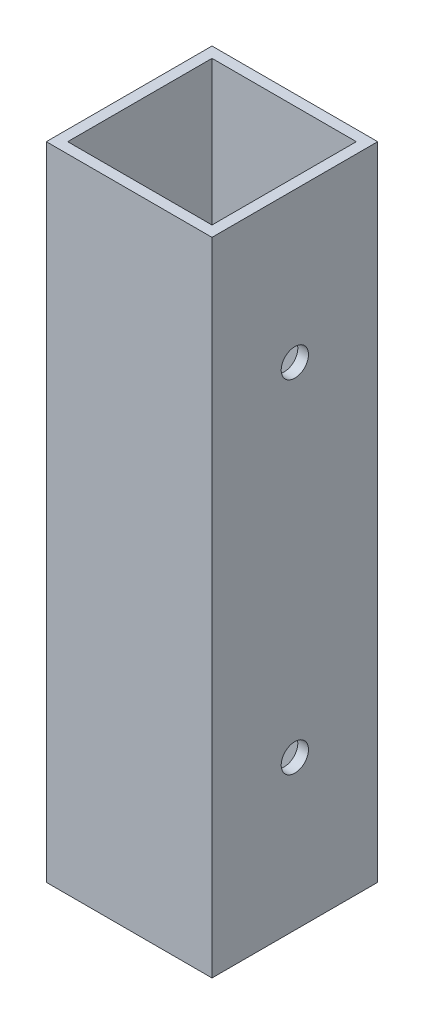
from build123d import *

# Parameters (mm, degrees)
SKETCH1_W                  = 31
SKETCH1_H                  = 31
SKETCH1_W_2                = 27
SKETCH1_H_2                = 27
BOSS_EXTRUDE1_DEPTH        = 120
F_10_CLEARANCE_HOLE2_D     = 5.1054
F_10_CLEARANCE_HOLE2_DEPTH = 5
F_10_CLEARANCE_HOLE2_TIP   = 1.533816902


with BuildPart() as part:
    # Sketch1 → Boss-Extrude1 (new body)
    with BuildSketch(Plane(origin=(0, 0, 0), x_dir=(1, 0, 0), z_dir=(0, 1, 0))):
        Rectangle(SKETCH1_W, SKETCH1_H)
        Rectangle(SKETCH1_W_2, SKETCH1_H_2, mode=Mode.SUBTRACT)
    extrude(amount=BOSS_EXTRUDE1_DEPTH)

    # 10 Clearance Hole2
    with Locations(Plane(origin=(15.5, 0, 0), x_dir=(0, 0, -1), z_dir=(1, 0, 0))):
        with Locations((0, 92), (0, 28)):
            Hole(F_10_CLEARANCE_HOLE2_D / 2, depth=F_10_CLEARANCE_HOLE2_DEPTH)
            with Locations((0, 0, -(F_10_CLEARANCE_HOLE2_DEPTH + F_10_CLEARANCE_HOLE2_TIP / 2))):  # 118° drill point
                Cone(0, F_10_CLEARANCE_HOLE2_D / 2, F_10_CLEARANCE_HOLE2_TIP, mode=Mode.SUBTRACT)


solid = part.part
